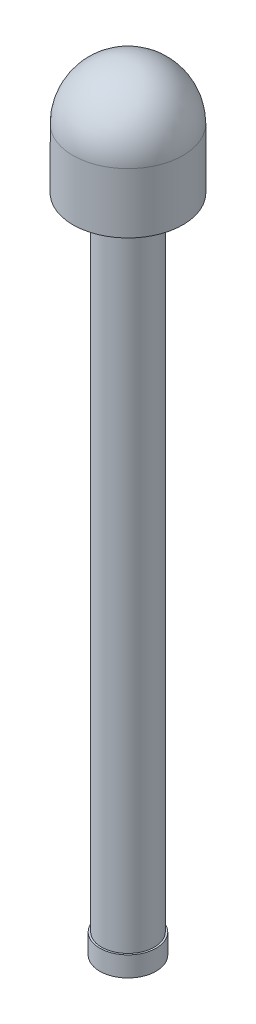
ISO-10303-21;
HEADER;
FILE_DESCRIPTION(('STEP AP214'),'2;1');
FILE_NAME('part.step','',(''),(''),'','','');
FILE_SCHEMA(('AUTOMOTIVE_DESIGN { 1 0 10303 214 1 1 1 1 }'));
ENDSEC;
DATA;
#1=APPLICATION_CONTEXT('core data for automotive mechanical design processes');
#2=APPLICATION_PROTOCOL_DEFINITION('international standard','automotive_design',2000,#1);
#3=PRODUCT_CONTEXT('',#1,'mechanical');
#4=PRODUCT('Part','Part','',(#3));
#5=PRODUCT_RELATED_PRODUCT_CATEGORY('part','',(#4));
#6=PRODUCT_DEFINITION_FORMATION('','',#4);
#7=PRODUCT_DEFINITION_CONTEXT('part definition',#1,'design');
#8=PRODUCT_DEFINITION('design','',#6,#7);
#9=PRODUCT_DEFINITION_SHAPE('','',#8);
#10=(LENGTH_UNIT() NAMED_UNIT(*) SI_UNIT(.MILLI.,.METRE.));
#11=(NAMED_UNIT(*) PLANE_ANGLE_UNIT() SI_UNIT($,.RADIAN.));
#12=(NAMED_UNIT(*) SI_UNIT($,.STERADIAN.) SOLID_ANGLE_UNIT());
#13=UNCERTAINTY_MEASURE_WITH_UNIT(LENGTH_MEASURE(1.E-05),#10,'distance_accuracy_value','');
#14=(GEOMETRIC_REPRESENTATION_CONTEXT(3) GLOBAL_UNCERTAINTY_ASSIGNED_CONTEXT((#13)) GLOBAL_UNIT_ASSIGNED_CONTEXT((#10,
#11,#12)) REPRESENTATION_CONTEXT('',''));
#15=CARTESIAN_POINT('',(0.,0.,0.));
#16=DIRECTION('',(0.,0.,1.));
#17=DIRECTION('',(1.,0.,0.));
#18=AXIS2_PLACEMENT_3D('',#15,#16,#17);
#19=CARTESIAN_POINT('',(0.,0.,0.));
#20=DIRECTION('',(0.,-1.,0.));
#21=DIRECTION('',(0.,0.,-1.));
#22=AXIS2_PLACEMENT_3D('',#19,#20,#21);
#23=PLANE('',#22);
#24=CARTESIAN_POINT('',(0.,0.,0.));
#25=DIRECTION('',(0.,1.,0.));
#26=DIRECTION('',(0.,0.,1.));
#27=AXIS2_PLACEMENT_3D('',#24,#25,#26);
#28=CIRCLE('',#27,14.2875);
#29=CARTESIAN_POINT('',(0.,0.,14.2875));
#30=VERTEX_POINT('',#29);
#31=EDGE_CURVE('E161',#30,#30,#28,.T.);
#32=ORIENTED_EDGE('',*,*,#31,.F.);
#33=EDGE_LOOP('',(#32));
#34=FACE_BOUND('',#33,.T.);
#35=ADVANCED_FACE('F41',(#34),#23,.T.);
#36=CARTESIAN_POINT('',(0.,393.42,0.));
#37=DIRECTION('',(0.,1.,0.));
#38=DIRECTION('',(0.,0.,1.));
#39=AXIS2_PLACEMENT_3D('',#36,#37,#38);
#40=CYLINDRICAL_SURFACE('',#39,14.2875);
#41=ORIENTED_EDGE('',*,*,#31,.T.);
#42=EDGE_LOOP('',(#41));
#43=FACE_BOUND('',#42,.T.);
#44=CARTESIAN_POINT('',(0.,10.16,0.));
#45=DIRECTION('',(0.,1.,0.));
#46=DIRECTION('',(0.,0.,1.));
#47=AXIS2_PLACEMENT_3D('',#44,#45,#46);
#48=CIRCLE('',#47,14.2875);
#49=CARTESIAN_POINT('',(0.,10.16,14.2875));
#50=VERTEX_POINT('',#49);
#51=EDGE_CURVE('E157',#50,#50,#48,.T.);
#52=ORIENTED_EDGE('',*,*,#51,.F.);
#53=EDGE_LOOP('',(#52));
#54=FACE_BOUND('',#53,.T.);
#55=ADVANCED_FACE('F222',(#43,#54),#40,.T.);
#56=CARTESIAN_POINT('',(-14.2875,10.16,0.));
#57=DIRECTION('',(0.,1.,0.));
#58=DIRECTION('',(0.,0.,1.));
#59=AXIS2_PLACEMENT_3D('',#56,#57,#58);
#60=PLANE('',#59);
#61=ORIENTED_EDGE('',*,*,#51,.T.);
#62=EDGE_LOOP('',(#61));
#63=FACE_BOUND('',#62,.T.);
#64=CARTESIAN_POINT('',(0.,10.16,0.));
#65=DIRECTION('',(0.,1.,0.));
#66=DIRECTION('',(0.,0.,1.));
#67=AXIS2_PLACEMENT_3D('',#64,#65,#66);
#68=CIRCLE('',#67,13.39215);
#69=CARTESIAN_POINT('',(0.,10.16,13.39215));
#70=VERTEX_POINT('',#69);
#71=EDGE_CURVE('E153',#70,#70,#68,.T.);
#72=ORIENTED_EDGE('',*,*,#71,.F.);
#73=EDGE_LOOP('',(#72));
#74=FACE_BOUND('',#73,.T.);
#75=ADVANCED_FACE('F226',(#63,#74),#60,.T.);
#76=CARTESIAN_POINT('',(0.,393.42,0.));
#77=DIRECTION('',(0.,1.,0.));
#78=DIRECTION('',(0.,0.,1.));
#79=AXIS2_PLACEMENT_3D('',#76,#77,#78);
#80=CYLINDRICAL_SURFACE('',#79,13.39215);
#81=ORIENTED_EDGE('',*,*,#71,.T.);
#82=EDGE_LOOP('',(#81));
#83=FACE_BOUND('',#82,.T.);
#84=CARTESIAN_POINT('',(0.,335.,0.));
#85=DIRECTION('',(0.,1.,0.));
#86=DIRECTION('',(0.,0.,1.));
#87=AXIS2_PLACEMENT_3D('',#84,#85,#86);
#88=CIRCLE('',#87,13.39215);
#89=CARTESIAN_POINT('',(0.,335.,13.39215));
#90=VERTEX_POINT('',#89);
#91=EDGE_CURVE('E149',#90,#90,#88,.T.);
#92=ORIENTED_EDGE('',*,*,#91,.F.);
#93=EDGE_LOOP('',(#92));
#94=FACE_BOUND('',#93,.T.);
#95=ADVANCED_FACE('F229',(#83,#94),#80,.T.);
#96=CARTESIAN_POINT('',(-13.39215,335.,0.));
#97=DIRECTION('',(0.,-1.,0.));
#98=DIRECTION('',(0.,0.,-1.));
#99=AXIS2_PLACEMENT_3D('',#96,#97,#98);
#100=PLANE('',#99);
#101=ORIENTED_EDGE('',*,*,#91,.T.);
#102=EDGE_LOOP('',(#101));
#103=FACE_BOUND('',#102,.T.);
#104=CARTESIAN_POINT('',(0.,335.,0.));
#105=DIRECTION('',(0.,1.,0.));
#106=DIRECTION('',(0.,0.,1.));
#107=AXIS2_PLACEMENT_3D('',#104,#105,#106);
#108=CIRCLE('',#107,27.94);
#109=CARTESIAN_POINT('',(0.,335.,27.94));
#110=VERTEX_POINT('',#109);
#111=EDGE_CURVE('E139',#110,#110,#108,.T.);
#112=ORIENTED_EDGE('',*,*,#111,.F.);
#113=EDGE_LOOP('',(#112));
#114=FACE_BOUND('',#113,.T.);
#115=ADVANCED_FACE('F203',(#103,#114),#100,.T.);
#116=CARTESIAN_POINT('',(0.,393.42,0.));
#117=DIRECTION('',(0.,1.,0.));
#118=DIRECTION('',(0.,0.,1.));
#119=AXIS2_PLACEMENT_3D('',#116,#117,#118);
#120=CYLINDRICAL_SURFACE('',#119,27.94);
#121=CARTESIAN_POINT('',(0.,358.390458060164,0.));
#122=DIRECTION('',(0.,-1.,0.));
#123=DIRECTION('',(0.,0.,-1.));
#124=AXIS2_PLACEMENT_3D('',#121,#122,#123);
#125=CIRCLE('',#124,27.94);
#126=CARTESIAN_POINT('',(-27.9399741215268,358.390458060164,0.038027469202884));
#127=VERTEX_POINT('',#126);
#128=CARTESIAN_POINT('',(-27.9399741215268,358.390458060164,-0.0380274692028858));
#129=VERTEX_POINT('',#128);
#130=EDGE_CURVE('E142',#127,#129,#125,.T.);
#131=ORIENTED_EDGE('',*,*,#130,.F.);
#132=CARTESIAN_POINT('',(-27.9399741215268,358.390458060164,0.038027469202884));
#133=CARTESIAN_POINT('',(-27.9397395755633,358.390478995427,0.223279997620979));
#134=CARTESIAN_POINT('',(-27.9376279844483,358.383099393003,0.408543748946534));
#135=CARTESIAN_POINT('',(-27.92977696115,358.353466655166,0.77782237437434));
#136=CARTESIAN_POINT('',(-27.9240370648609,358.331211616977,0.961837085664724));
#137=CARTESIAN_POINT('',(-27.9090583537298,358.271765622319,1.32723607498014));
#138=CARTESIAN_POINT('',(-27.8998207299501,358.234579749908,1.50862122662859));
#139=CARTESIAN_POINT('',(-27.8780981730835,358.145367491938,1.86749530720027));
#140=CARTESIAN_POINT('',(-27.8656134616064,358.093342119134,2.04498450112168));
#141=CARTESIAN_POINT('',(-27.8377146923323,357.974590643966,2.39501917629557));
#142=CARTESIAN_POINT('',(-27.8222965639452,357.907844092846,2.56755739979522));
#143=CARTESIAN_POINT('',(-27.7889691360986,357.760061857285,2.90615498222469));
#144=CARTESIAN_POINT('',(-27.7710598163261,357.67902605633,3.07221428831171));
#145=CARTESIAN_POINT('',(-27.7332588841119,357.503215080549,3.39655727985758));
#146=CARTESIAN_POINT('',(-27.713368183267,357.408446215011,3.55484449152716));
#147=CARTESIAN_POINT('',(-27.6721555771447,357.205781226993,3.86257809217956));
#148=CARTESIAN_POINT('',(-27.6508336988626,357.097885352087,4.01202464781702));
#149=CARTESIAN_POINT('',(-27.6076730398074,356.871381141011,4.2989221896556));
#150=CARTESIAN_POINT('',(-27.5858462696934,356.752951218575,4.43651591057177));
#151=CARTESIAN_POINT('',(-27.541970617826,356.504858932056,4.7012193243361));
#152=CARTESIAN_POINT('',(-27.5199216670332,356.375192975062,4.82832563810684));
#153=CARTESIAN_POINT('',(-27.4762044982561,356.105552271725,5.07119489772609));
#154=CARTESIAN_POINT('',(-27.4545363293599,355.965576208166,5.18695638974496));
#155=CARTESIAN_POINT('',(-27.4121697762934,355.676309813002,5.40638874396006));
#156=CARTESIAN_POINT('',(-27.3914714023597,355.527019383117,5.51005947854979));
#157=CARTESIAN_POINT('',(-27.3514798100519,355.21921999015,5.70527346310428));
#158=CARTESIAN_POINT('',(-27.3321960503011,355.060659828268,5.7967379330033));
#159=CARTESIAN_POINT('',(-27.2957067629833,354.736339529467,5.96619682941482));
#160=CARTESIAN_POINT('',(-27.2785005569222,354.57058176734,6.04419565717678));
#161=CARTESIAN_POINT('',(-27.2466294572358,354.233001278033,6.18628254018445));
#162=CARTESIAN_POINT('',(-27.2319640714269,354.061179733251,6.25037329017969));
#163=CARTESIAN_POINT('',(-27.2055702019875,353.712717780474,6.36427146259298));
#164=CARTESIAN_POINT('',(-27.1938411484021,353.536078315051,6.41408165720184));
#165=CARTESIAN_POINT('',(-27.169200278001,353.100637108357,6.51783847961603));
#166=CARTESIAN_POINT('',(-27.1580303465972,352.83981373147,6.56399856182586));
#167=CARTESIAN_POINT('',(-27.1468162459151,352.446067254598,6.61015696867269));
#168=CARTESIAN_POINT('',(-27.1440016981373,352.314453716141,6.62169614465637));
#169=CARTESIAN_POINT('',(-27.1402410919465,352.050726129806,6.63708904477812));
#170=CARTESIAN_POINT('',(-27.1392953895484,351.918611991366,6.64094130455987));
#171=CARTESIAN_POINT('',(-27.1392974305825,351.786458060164,6.64094383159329));
#172=B_SPLINE_CURVE_WITH_KNOTS('',3,(#132,#133,#134,#135,#136,#137,#138,#139,#140,#141,#142,
#143,#144,#145,#146,#147,#148,#149,#150,#151,#152,#153,#154,#155,#156,#157,#158,#159,#160,#161,
#162,#163,#164,#165,#166,#167,#168,#169,#170,#171),.UNSPECIFIED.,.F.,.F.,(4,2,2,2,2,2,2,2,2,2,2,
2,2,2,2,2,2,2,2,4),(0.,0.555621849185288,1.11131478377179,1.66681866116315,2.22228463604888,
2.77852710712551,3.33477411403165,3.89076637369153,4.44674814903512,4.9946522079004,
5.54273211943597,6.0908821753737,6.6390380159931,7.19057625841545,7.74193388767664,
8.29318459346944,8.84432821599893,9.63746521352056,10.0337126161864,10.4300354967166),.UNSPECIFIED.);
#173=CARTESIAN_POINT('',(-27.1392974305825,351.786458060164,6.64094383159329));
#174=VERTEX_POINT('',#173);
#175=EDGE_CURVE('E52',#127,#174,#172,.T.);
#176=ORIENTED_EDGE('',*,*,#175,.T.);
#177=DIRECTION('',(0.,-1.,0.));
#178=VECTOR('',#177,1.);
#179=CARTESIAN_POINT('',(-27.1392974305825,358.390458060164,6.64094383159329));
#180=LINE('',#179,#178);
#181=CARTESIAN_POINT('',(-27.1392974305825,345.16,6.64094383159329));
#182=VERTEX_POINT('',#181);
#183=EDGE_CURVE('E132',#174,#182,#180,.T.);
#184=ORIENTED_EDGE('',*,*,#183,.T.);
#185=CARTESIAN_POINT('',(0.,345.16,0.));
#186=DIRECTION('',(0.,-1.,0.));
#187=DIRECTION('',(0.,0.,-1.));
#188=AXIS2_PLACEMENT_3D('',#185,#186,#187);
#189=CIRCLE('',#188,27.94);
#190=CARTESIAN_POINT('',(-27.1392974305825,345.16,-6.64094383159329));
#191=VERTEX_POINT('',#190);
#192=EDGE_CURVE('E122',#182,#191,#189,.T.);
#193=ORIENTED_EDGE('',*,*,#192,.T.);
#194=DIRECTION('',(0.,-1.,0.));
#195=VECTOR('',#194,1.);
#196=CARTESIAN_POINT('',(-27.1392974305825,358.390458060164,-6.64094383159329));
#197=LINE('',#196,#195);
#198=CARTESIAN_POINT('',(-27.1392974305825,351.786458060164,-6.64094383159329));
#199=VERTEX_POINT('',#198);
#200=EDGE_CURVE('E108',#199,#191,#197,.T.);
#201=ORIENTED_EDGE('',*,*,#200,.F.);
#202=CARTESIAN_POINT('',(-27.1392974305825,351.786458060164,-6.64094383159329));
#203=CARTESIAN_POINT('',(-27.1392791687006,351.97209983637,-6.64095988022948));
#204=CARTESIAN_POINT('',(-27.1411573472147,352.157738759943,-6.63334113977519));
#205=CARTESIAN_POINT('',(-27.1485746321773,352.527690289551,-6.60294994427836));
#206=CARTESIAN_POINT('',(-27.1541135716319,352.712002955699,-6.58017818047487));
#207=CARTESIAN_POINT('',(-27.1687156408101,353.077878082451,-6.51961671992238));
#208=CARTESIAN_POINT('',(-27.1777764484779,353.259442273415,-6.48183691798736));
#209=CARTESIAN_POINT('',(-27.1991664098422,353.618653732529,-6.39148764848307));
#210=CARTESIAN_POINT('',(-27.2114955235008,353.796301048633,-6.33891836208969));
#211=CARTESIAN_POINT('',(-27.2390880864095,354.146479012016,-6.21927993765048));
#212=CARTESIAN_POINT('',(-27.2543525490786,354.31900786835,-6.15220579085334));
#213=CARTESIAN_POINT('',(-27.2873965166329,354.657714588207,-6.00394527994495));
#214=CARTESIAN_POINT('',(-27.305176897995,354.823890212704,-5.92275399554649));
#215=CARTESIAN_POINT('',(-27.3427500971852,355.148583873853,-5.74679934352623));
#216=CARTESIAN_POINT('',(-27.3625422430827,355.307104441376,-5.65204050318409));
#217=CARTESIAN_POINT('',(-27.4035947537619,355.615408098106,-5.44951967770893));
#218=CARTESIAN_POINT('',(-27.4248551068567,355.765191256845,-5.34175779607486));
#219=CARTESIAN_POINT('',(-27.4682058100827,356.054628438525,-5.11416221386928));
#220=CARTESIAN_POINT('',(-27.4902942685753,356.194303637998,-4.99435508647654));
#221=CARTESIAN_POINT('',(-27.534722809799,356.462830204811,-4.74329840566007));
#222=CARTESIAN_POINT('',(-27.5570628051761,356.591685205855,-4.61205272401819));
#223=CARTESIAN_POINT('',(-27.6013823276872,356.837717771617,-4.33894333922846));
#224=CARTESIAN_POINT('',(-27.6233617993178,356.954893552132,-4.19707801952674));
#225=CARTESIAN_POINT('',(-27.6663417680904,357.176710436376,-3.90372931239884));
#226=CARTESIAN_POINT('',(-27.6873422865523,357.281351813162,-3.75224613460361));
#227=CARTESIAN_POINT('',(-27.7275841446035,357.476441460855,-3.44221916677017));
#228=CARTESIAN_POINT('',(-27.7468403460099,357.5670155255,-3.28375645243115));
#229=CARTESIAN_POINT('',(-27.7832884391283,357.734567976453,-2.95957575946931));
#230=CARTESIAN_POINT('',(-27.8004803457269,357.811546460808,-2.79385783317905));
#231=CARTESIAN_POINT('',(-27.8323294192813,357.951438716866,-2.45636860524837));
#232=CARTESIAN_POINT('',(-27.8469868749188,358.01435409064,-2.28459799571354));
#233=CARTESIAN_POINT('',(-27.8733721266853,358.125789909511,-1.93630151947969));
#234=CARTESIAN_POINT('',(-27.8851005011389,358.17431319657,-1.75977659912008));
#235=CARTESIAN_POINT('',(-27.9095320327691,358.273992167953,-1.32872081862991));
#236=CARTESIAN_POINT('',(-27.9206038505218,358.31781481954,-1.07234456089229));
#237=CARTESIAN_POINT('',(-27.9318873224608,358.361482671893,-0.68553959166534));
#238=CARTESIAN_POINT('',(-27.9347609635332,358.372361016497,-0.556315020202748));
#239=CARTESIAN_POINT('',(-27.9387170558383,358.386848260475,-0.297414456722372));
#240=CARTESIAN_POINT('',(-27.9397992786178,358.390456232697,-0.167738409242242));
#241=CARTESIAN_POINT('',(-27.9399741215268,358.390458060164,-0.0380274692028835));
#242=B_SPLINE_CURVE_WITH_KNOTS('',3,(#202,#203,#204,#205,#206,#207,#208,#209,#210,#211,#212,
#213,#214,#215,#216,#217,#218,#219,#220,#221,#222,#223,#224,#225,#226,#227,#228,#229,#230,#231,
#232,#233,#234,#235,#236,#237,#238,#239,#240,#241),.UNSPECIFIED.,.F.,.F.,(4,2,2,2,2,2,2,2,2,2,2,
2,2,2,2,2,2,2,2,4),(0.,0.556755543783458,1.11348569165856,1.66984939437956,2.22620628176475,
2.78275559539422,3.33949927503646,3.89605760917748,4.45261151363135,5.00796347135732,
5.56312817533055,6.11837756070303,6.67361484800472,7.22355903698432,7.77349925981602,
8.32337680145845,8.87314568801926,9.65206757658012,10.0410284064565,10.4300388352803),.UNSPECIFIED.);
#243=EDGE_CURVE('E11',#199,#129,#242,.T.);
#244=ORIENTED_EDGE('',*,*,#243,.T.);
#245=EDGE_LOOP('',(#131,#176,#184,#193,#201,#244));
#246=FACE_BOUND('',#245,.T.);
#247=ORIENTED_EDGE('',*,*,#111,.T.);
#248=EDGE_LOOP('',(#247));
#249=FACE_BOUND('',#248,.T.);
#250=CARTESIAN_POINT('',(0.,365.48,0.));
#251=DIRECTION('',(0.,1.,0.));
#252=DIRECTION('',(0.,0.,1.));
#253=AXIS2_PLACEMENT_3D('',#250,#251,#252);
#254=CIRCLE('',#253,27.94);
#255=CARTESIAN_POINT('',(0.,365.48,27.94));
#256=VERTEX_POINT('',#255);
#257=EDGE_CURVE('E134',#256,#256,#254,.T.);
#258=ORIENTED_EDGE('',*,*,#257,.F.);
#259=EDGE_LOOP('',(#258));
#260=FACE_BOUND('',#259,.T.);
#261=ADVANCED_FACE('F129',(#246,#249,#260),#120,.T.);
#262=CARTESIAN_POINT('',(0.,365.48,0.));
#263=DIRECTION('',(0.,1.,0.));
#264=DIRECTION('',(-1.,0.,0.));
#265=AXIS2_PLACEMENT_3D('',#262,#263,#264);
#266=SPHERICAL_SURFACE('',#265,27.94);
#267=ORIENTED_EDGE('',*,*,#257,.T.);
#268=EDGE_LOOP('',(#267));
#269=FACE_BOUND('',#268,.T.);
#270=ADVANCED_FACE('F196',(#269),#266,.T.);
#271=CARTESIAN_POINT('',(-27.1392974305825,345.16,6.64094383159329));
#272=DIRECTION('',(0.,1.,0.));
#273=DIRECTION('',(0.,0.,1.));
#274=AXIS2_PLACEMENT_3D('',#271,#272,#273);
#275=PLANE('',#274);
#276=CARTESIAN_POINT('',(0.,345.16,0.));
#277=DIRECTION('',(0.,-1.,0.));
#278=DIRECTION('',(0.,0.,-1.));
#279=AXIS2_PLACEMENT_3D('',#276,#277,#278);
#280=CIRCLE('',#279,26.67);
#281=CARTESIAN_POINT('',(-25.9056930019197,345.16,6.33908274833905));
#282=VERTEX_POINT('',#281);
#283=CARTESIAN_POINT('',(-25.9056930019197,345.16,-6.33908274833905));
#284=VERTEX_POINT('',#283);
#285=EDGE_CURVE('E124',#282,#284,#280,.T.);
#286=ORIENTED_EDGE('',*,*,#285,.T.);
#287=DIRECTION('',(0.971342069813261,0.,0.237685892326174));
#288=VECTOR('',#287,1.);
#289=CARTESIAN_POINT('',(-27.1392974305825,345.16,-6.64094383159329));
#290=LINE('',#289,#288);
#291=EDGE_CURVE('E111',#191,#284,#290,.T.);
#292=ORIENTED_EDGE('',*,*,#291,.F.);
#293=ORIENTED_EDGE('',*,*,#192,.F.);
#294=DIRECTION('',(0.971342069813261,0.,-0.237685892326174));
#295=VECTOR('',#294,1.);
#296=CARTESIAN_POINT('',(-27.1392974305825,345.16,6.64094383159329));
#297=LINE('',#296,#295);
#298=EDGE_CURVE('E347',#182,#282,#297,.T.);
#299=ORIENTED_EDGE('',*,*,#298,.T.);
#300=EDGE_LOOP('',(#286,#292,#293,#299));
#301=FACE_BOUND('',#300,.T.);
#302=ADVANCED_FACE('F120',(#301),#275,.T.);
#303=CARTESIAN_POINT('',(0.,335.220960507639,0.));
#304=DIRECTION('',(0.,-1.,0.));
#305=DIRECTION('',(0.,0.,-1.));
#306=AXIS2_PLACEMENT_3D('',#303,#304,#305);
#307=CYLINDRICAL_SURFACE('',#306,26.67);
#308=DIRECTION('',(0.,1.,0.));
#309=VECTOR('',#308,1.);
#310=CARTESIAN_POINT('',(-25.9056930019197,358.390458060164,6.33908274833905));
#311=LINE('',#310,#309);
#312=CARTESIAN_POINT('',(-25.9056930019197,351.786458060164,6.33908274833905));
#313=VERTEX_POINT('',#312);
#314=EDGE_CURVE('E349',#282,#313,#311,.T.);
#315=ORIENTED_EDGE('',*,*,#314,.T.);
#316=CARTESIAN_POINT('',(-25.9056930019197,351.786458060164,6.33908274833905));
#317=CARTESIAN_POINT('',(-25.9056741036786,351.972081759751,6.33909863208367));
#318=CARTESIAN_POINT('',(-25.9075525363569,352.157702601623,6.33148153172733));
#319=CARTESIAN_POINT('',(-25.9149675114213,352.527618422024,6.30109603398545));
#320=CARTESIAN_POINT('',(-25.9205038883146,352.711913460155,6.2783283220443));
#321=CARTESIAN_POINT('',(-25.935094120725,353.077771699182,6.21777327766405));
#322=CARTESIAN_POINT('',(-25.9441459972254,353.259336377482,6.17999439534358));
#323=CARTESIAN_POINT('',(-25.9655023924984,353.618549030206,6.08964309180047));
#324=CARTESIAN_POINT('',(-25.9778068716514,353.79619705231,6.03707085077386));
#325=CARTESIAN_POINT('',(-26.0053223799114,354.146373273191,5.91742090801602));
#326=CARTESIAN_POINT('',(-26.0205343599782,354.318899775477,5.85033845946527));
#327=CARTESIAN_POINT('',(-26.0534314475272,354.65760524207,5.70205025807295));
#328=CARTESIAN_POINT('',(-26.0711174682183,354.823781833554,5.62083928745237));
#329=CARTESIAN_POINT('',(-26.1084380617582,355.14843381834,5.44485475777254));
#330=CARTESIAN_POINT('',(-26.128071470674,355.306913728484,5.35008928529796));
#331=CARTESIAN_POINT('',(-26.168735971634,355.615196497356,5.14750717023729));
#332=CARTESIAN_POINT('',(-26.1897675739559,355.764996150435,5.03968575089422));
#333=CARTESIAN_POINT('',(-26.2325514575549,356.054373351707,4.81201803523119));
#334=CARTESIAN_POINT('',(-26.2543015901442,356.1939779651,4.6922057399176));
#335=CARTESIAN_POINT('',(-26.2979444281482,356.462415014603,4.44108711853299));
#336=CARTESIAN_POINT('',(-26.3198371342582,356.591247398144,4.30978073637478));
#337=CARTESIAN_POINT('',(-26.363123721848,356.837218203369,4.03654992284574));
#338=CARTESIAN_POINT('',(-26.3845175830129,356.954356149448,3.8946250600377));
#339=CARTESIAN_POINT('',(-26.4261733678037,357.176101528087,3.60114183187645));
#340=CARTESIAN_POINT('',(-26.4464352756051,357.280708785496,3.44958333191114));
#341=CARTESIAN_POINT('',(-26.4850148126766,357.475613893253,3.1395891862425));
#342=CARTESIAN_POINT('',(-26.5033509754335,357.566053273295,2.98124480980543));
#343=CARTESIAN_POINT('',(-26.5377920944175,357.733404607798,2.65726047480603));
#344=CARTESIAN_POINT('',(-26.5538962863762,357.810311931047,2.4916180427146));
#345=CARTESIAN_POINT('',(-26.5833825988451,357.950073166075,2.15436869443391));
#346=CARTESIAN_POINT('',(-26.596766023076,358.012933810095,1.98276468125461));
#347=CARTESIAN_POINT('',(-26.6204263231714,358.124353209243,1.6346983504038));
#348=CARTESIAN_POINT('',(-26.6307020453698,358.172906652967,1.45823425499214));
#349=CARTESIAN_POINT('',(-26.6478097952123,358.255408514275,1.10219075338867));
#350=CARTESIAN_POINT('',(-26.6546496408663,358.289390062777,0.922619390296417));
#351=CARTESIAN_POINT('',(-26.664708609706,358.342877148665,0.561171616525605));
#352=CARTESIAN_POINT('',(-26.6679264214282,358.36237744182,0.379294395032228));
#353=CARTESIAN_POINT('',(-26.6706191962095,358.386960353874,0.0145982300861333));
#354=CARTESIAN_POINT('',(-26.6700952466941,358.392047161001,-0.168220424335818));
#355=CARTESIAN_POINT('',(-26.6652860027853,358.388007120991,-0.533710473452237));
#356=CARTESIAN_POINT('',(-26.6609992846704,358.378874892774,-0.716381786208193));
#357=CARTESIAN_POINT('',(-26.6485330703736,358.346144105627,-1.08622541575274));
#358=CARTESIAN_POINT('',(-26.6402328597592,358.322089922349,-1.27335364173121));
#359=CARTESIAN_POINT('',(-26.6198729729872,358.259515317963,-1.64498950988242));
#360=CARTESIAN_POINT('',(-26.6078119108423,358.220989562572,-1.82949615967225));
#361=CARTESIAN_POINT('',(-26.5663419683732,358.084310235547,-2.37740026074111));
#362=CARTESIAN_POINT('',(-26.5316400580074,357.965038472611,-2.73535807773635));
#363=CARTESIAN_POINT('',(-26.4486113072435,357.665160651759,-3.44922480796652));
#364=CARTESIAN_POINT('',(-26.3995742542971,357.481216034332,-3.80363636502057));
#365=CARTESIAN_POINT('',(-26.2937380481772,357.059083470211,-4.47709057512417));
#366=CARTESIAN_POINT('',(-26.2369433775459,356.820926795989,-4.79615346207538));
#367=CARTESIAN_POINT('',(-26.1325323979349,356.345865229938,-5.33286185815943));
#368=CARTESIAN_POINT('',(-26.0852539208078,356.117545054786,-5.55820682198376));
#369=CARTESIAN_POINT('',(-25.9929249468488,355.631550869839,-5.97517455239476));
#370=CARTESIAN_POINT('',(-25.9478747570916,355.373872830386,-6.16679268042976));
#371=CARTESIAN_POINT('',(-25.9056930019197,355.102958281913,-6.33908274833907));
#372=B_SPLINE_CURVE_WITH_KNOTS('',3,(#316,#317,#318,#319,#320,#321,#322,#323,#324,#325,#326,
#327,#328,#329,#330,#331,#332,#333,#334,#335,#336,#337,#338,#339,#340,#341,#342,#343,#344,#345,
#346,#347,#348,#349,#350,#351,#352,#353,#354,#355,#356,#357,#358,#359,#360,#361,#362,#363,#364,
#365,#366,#367,#368,#369,#370,#371),.UNSPECIFIED.,.F.,.F.,(4,2,2,2,2,2,2,2,2,2,2,2,2,2,2,2,2,2,
2,2,2,2,2,2,2,2,2,4),(0.,0.556701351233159,1.11337751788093,1.6697407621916,2.22609722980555,
2.7826359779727,3.33938069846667,3.89579464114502,4.4524127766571,5.00749504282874,
5.56258001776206,6.11768755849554,6.67280285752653,7.22196022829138,7.77130517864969,
8.32038627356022,8.8696709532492,9.41770006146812,9.9659275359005,10.5139956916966,
11.062271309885,11.6281728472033,12.1942831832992,13.3259786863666,14.5277011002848,
15.7287320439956,16.6985580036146,17.6685172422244),.UNSPECIFIED.);
#373=CARTESIAN_POINT('',(-26.67,358.385142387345,0.));
#374=VERTEX_POINT('',#373);
#375=EDGE_CURVE('E71',#313,#374,#372,.T.);
#376=ORIENTED_EDGE('',*,*,#375,.T.);
#377=CARTESIAN_POINT('',(-25.9056930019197,355.102958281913,6.33908274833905));
#378=CARTESIAN_POINT('',(-25.9319200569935,355.271491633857,6.23191242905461));
#379=CARTESIAN_POINT('',(-25.9592849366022,355.434980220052,6.11719334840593));
#380=CARTESIAN_POINT('',(-26.0153954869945,355.750989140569,5.87397819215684));
#381=CARTESIAN_POINT('',(-26.0441404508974,355.903514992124,5.7454891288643));
#382=CARTESIAN_POINT('',(-26.1020969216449,356.196650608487,5.47616529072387));
#383=CARTESIAN_POINT('',(-26.1313075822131,356.337279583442,5.33535119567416));
#384=CARTESIAN_POINT('',(-26.1894280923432,356.606287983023,5.04232766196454));
#385=CARTESIAN_POINT('',(-26.2183378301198,356.734662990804,4.89011414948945));
#386=CARTESIAN_POINT('',(-26.2750219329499,356.978266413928,4.5757603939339));
#387=CARTESIAN_POINT('',(-26.3027982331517,357.093517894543,4.41363836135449));
#388=CARTESIAN_POINT('',(-26.3565607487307,357.310545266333,4.0803307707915));
#389=CARTESIAN_POINT('',(-26.3825469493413,357.412321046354,3.90914513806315));
#390=CARTESIAN_POINT('',(-26.4320990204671,357.601867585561,3.55870402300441));
#391=CARTESIAN_POINT('',(-26.4556632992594,357.68962915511,3.37944334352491));
#392=CARTESIAN_POINT('',(-26.4997660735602,357.850445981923,3.01415501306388));
#393=CARTESIAN_POINT('',(-26.5203055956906,357.923506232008,2.82812968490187));
#394=CARTESIAN_POINT('',(-26.5584980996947,358.056569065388,2.44408411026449));
#395=CARTESIAN_POINT('',(-26.5760309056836,358.116050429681,2.24587084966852));
#396=CARTESIAN_POINT('',(-26.6068736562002,358.218059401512,1.8448824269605));
#397=CARTESIAN_POINT('',(-26.6201852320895,358.260593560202,1.64210905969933));
#398=CARTESIAN_POINT('',(-26.6422489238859,358.328154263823,1.23342702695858));
#399=CARTESIAN_POINT('',(-26.6510013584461,358.353182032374,1.02751858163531));
#400=CARTESIAN_POINT('',(-26.6637292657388,358.385228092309,0.61415692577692));
#401=CARTESIAN_POINT('',(-26.6677050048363,358.392247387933,0.406703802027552));
#402=CARTESIAN_POINT('',(-26.6707363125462,358.387991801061,0.00117122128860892));
#403=CARTESIAN_POINT('',(-26.6700026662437,358.377515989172,-0.196915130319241));
#404=CARTESIAN_POINT('',(-26.664171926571,358.339571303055,-0.591387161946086));
#405=CARTESIAN_POINT('',(-26.6590750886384,358.312103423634,-0.787772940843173));
#406=CARTESIAN_POINT('',(-26.6447194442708,358.240142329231,-1.17719230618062));
#407=CARTESIAN_POINT('',(-26.6354618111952,358.195653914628,-1.37022682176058));
#408=CARTESIAN_POINT('',(-26.6131172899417,358.089786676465,-1.75137912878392));
#409=CARTESIAN_POINT('',(-26.6000305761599,358.028408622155,-1.93949714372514));
#410=CARTESIAN_POINT('',(-26.5713636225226,357.893222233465,-2.29825674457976));
#411=CARTESIAN_POINT('',(-26.5559771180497,357.820366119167,-2.46927334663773));
#412=CARTESIAN_POINT('',(-26.5226951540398,357.660422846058,-2.80425960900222));
#413=CARTESIAN_POINT('',(-26.5047997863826,357.573336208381,-2.96822952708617));
#414=CARTESIAN_POINT('',(-26.4670469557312,357.385505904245,-3.28789170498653));
#415=CARTESIAN_POINT('',(-26.4471896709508,357.284763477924,-3.44358471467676));
#416=CARTESIAN_POINT('',(-26.4061125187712,357.070311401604,-3.74557710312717));
#417=CARTESIAN_POINT('',(-26.3848926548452,356.956601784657,-3.89187650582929));
#418=CARTESIAN_POINT('',(-26.3421856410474,356.719569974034,-4.17105244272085));
#419=CARTESIAN_POINT('',(-26.3207136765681,356.596502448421,-4.30414767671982));
#420=CARTESIAN_POINT('',(-26.2776815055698,356.339539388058,-4.55950982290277));
#421=CARTESIAN_POINT('',(-26.2561212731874,356.205640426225,-4.68177328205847));
#422=CARTESIAN_POINT('',(-26.2135323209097,355.92799504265,-4.91463498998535));
#423=CARTESIAN_POINT('',(-26.1925035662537,355.784249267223,-5.02523400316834));
#424=CARTESIAN_POINT('',(-26.1515679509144,355.487905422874,-5.23409233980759));
#425=CARTESIAN_POINT('',(-26.1316611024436,355.335307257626,-5.33235152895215));
#426=CARTESIAN_POINT('',(-26.093366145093,355.021003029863,-5.5167097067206));
#427=CARTESIAN_POINT('',(-26.0749922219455,354.859231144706,-5.60269943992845));
#428=CARTESIAN_POINT('',(-26.0404783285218,354.528962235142,-5.760985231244));
#429=CARTESIAN_POINT('',(-26.0243376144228,354.360467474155,-5.83328585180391));
#430=CARTESIAN_POINT('',(-25.9947425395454,354.017925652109,-5.96378581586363));
#431=CARTESIAN_POINT('',(-25.9812874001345,353.843880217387,-6.02198924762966));
#432=CARTESIAN_POINT('',(-25.9574390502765,353.491479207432,-6.12396871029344));
#433=CARTESIAN_POINT('',(-25.9470450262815,353.313124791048,-6.16774857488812));
#434=CARTESIAN_POINT('',(-25.9275964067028,352.911705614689,-6.24906534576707));
#435=CARTESIAN_POINT('',(-25.9194035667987,352.687815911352,-6.28283385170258));
#436=CARTESIAN_POINT('',(-25.9111896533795,352.350477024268,-6.31658624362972));
#437=CARTESIAN_POINT('',(-25.909130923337,352.237852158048,-6.32502030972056));
#438=CARTESIAN_POINT('',(-25.90638202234,352.01231192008,-6.33626786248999));
#439=CARTESIAN_POINT('',(-25.9056917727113,351.899396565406,-6.33908167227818));
#440=CARTESIAN_POINT('',(-25.9056930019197,351.786458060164,-6.33908274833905));
#441=B_SPLINE_CURVE_WITH_KNOTS('',3,(#377,#378,#379,#380,#381,#382,#383,#384,#385,#386,#387,
#388,#389,#390,#391,#392,#393,#394,#395,#396,#397,#398,#399,#400,#401,#402,#403,#404,#405,#406,
#407,#408,#409,#410,#411,#412,#413,#414,#415,#416,#417,#418,#419,#420,#421,#422,#423,#424,#425,
#426,#427,#428,#429,#430,#431,#432,#433,#434,#435,#436,#437,#438,#439,#440),.UNSPECIFIED.,.F.,
.F.,(4,2,2,2,2,2,2,2,2,2,2,2,2,2,2,2,2,2,2,2,2,2,2,2,2,2,2,2,2,2,2,4),(0.,0.604023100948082,
1.20774005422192,1.81046278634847,2.41340195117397,3.01526450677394,3.61713202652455,
4.21939260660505,4.8214483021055,5.4437330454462,6.06577700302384,6.68777747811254,
7.30974326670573,7.90407101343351,8.49836396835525,9.09248943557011,9.68658784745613,
10.245478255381,10.80434820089,11.3631674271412,11.9219852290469,12.4689647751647,
13.0161180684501,13.5632354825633,14.1103588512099,14.6620850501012,15.2136270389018,
15.7650088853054,16.3162440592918,16.9946090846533,17.333360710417,17.6720928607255),.UNSPECIFIED.);
#442=CARTESIAN_POINT('',(-25.9056930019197,351.786458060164,-6.33908274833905));
#443=VERTEX_POINT('',#442);
#444=EDGE_CURVE('E175',#374,#443,#441,.T.);
#445=ORIENTED_EDGE('',*,*,#444,.T.);
#446=DIRECTION('',(0.,1.,0.));
#447=VECTOR('',#446,1.);
#448=CARTESIAN_POINT('',(-25.9056930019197,358.390458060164,-6.33908274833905));
#449=LINE('',#448,#447);
#450=EDGE_CURVE('E126',#284,#443,#449,.T.);
#451=ORIENTED_EDGE('',*,*,#450,.F.);
#452=ORIENTED_EDGE('',*,*,#285,.F.);
#453=EDGE_LOOP('',(#315,#376,#445,#451,#452));
#454=FACE_BOUND('',#453,.T.);
#455=ADVANCED_FACE('F186',(#454),#307,.T.);
#456=CARTESIAN_POINT('',(-27.1392974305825,358.390458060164,6.64094383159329));
#457=DIRECTION('',(0.,-1.,0.));
#458=DIRECTION('',(0.,0.,-1.));
#459=AXIS2_PLACEMENT_3D('',#456,#457,#458);
#460=PLANE('',#459);
#461=DIRECTION('',(-0.971342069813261,0.,-0.237685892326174));
#462=VECTOR('',#461,1.);
#463=CARTESIAN_POINT('',(-27.4753706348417,358.390458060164,0.0756602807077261));
#464=LINE('',#463,#462);
#465=CARTESIAN_POINT('',(-27.7845686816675,358.390458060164,0.));
#466=VERTEX_POINT('',#465);
#467=EDGE_CURVE('E165',#129,#466,#464,.F.);
#468=ORIENTED_EDGE('',*,*,#467,.T.);
#469=DIRECTION('',(-0.971342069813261,0.,0.237685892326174));
#470=VECTOR('',#469,1.);
#471=CARTESIAN_POINT('',(-28.7089750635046,358.390458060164,0.226200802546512));
#472=LINE('',#471,#470);
#473=EDGE_CURVE('E168',#466,#127,#472,.T.);
#474=ORIENTED_EDGE('',*,*,#473,.T.);
#475=ORIENTED_EDGE('',*,*,#130,.T.);
#476=EDGE_LOOP('',(#468,#474,#475));
#477=FACE_BOUND('',#476,.T.);
#478=ADVANCED_FACE('F191',(#477),#460,.T.);
#479=CARTESIAN_POINT('',(0.,0.,0.));
#480=DIRECTION('',(0.237685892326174,0.,0.971342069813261));
#481=DIRECTION('',(0.971342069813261,0.,-0.237685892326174));
#482=AXIS2_PLACEMENT_3D('',#479,#480,#481);
#483=PLANE('',#482);
#484=ORIENTED_EDGE('',*,*,#183,.F.);
#485=DIRECTION('',(-0.971342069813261,0.,0.237685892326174));
#486=VECTOR('',#485,1.);
#487=CARTESIAN_POINT('',(0.,351.786458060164,0.));
#488=LINE('',#487,#486);
#489=EDGE_CURVE('E172',#174,#313,#488,.F.);
#490=ORIENTED_EDGE('',*,*,#489,.T.);
#491=ORIENTED_EDGE('',*,*,#314,.F.);
#492=ORIENTED_EDGE('',*,*,#298,.F.);
#493=EDGE_LOOP('',(#484,#490,#491,#492));
#494=FACE_BOUND('',#493,.T.);
#495=ADVANCED_FACE('F266',(#494),#483,.F.);
#496=CARTESIAN_POINT('',(0.,0.,0.));
#497=DIRECTION('',(-0.237685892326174,0.,0.971342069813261));
#498=DIRECTION('',(0.971342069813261,0.,0.237685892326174));
#499=AXIS2_PLACEMENT_3D('',#496,#497,#498);
#500=PLANE('',#499);
#501=ORIENTED_EDGE('',*,*,#450,.T.);
#502=DIRECTION('',(-0.971342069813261,0.,-0.237685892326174));
#503=VECTOR('',#502,1.);
#504=CARTESIAN_POINT('',(-27.1392974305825,351.786458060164,-6.64094383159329));
#505=LINE('',#504,#503);
#506=EDGE_CURVE('E62',#443,#199,#505,.T.);
#507=ORIENTED_EDGE('',*,*,#506,.T.);
#508=ORIENTED_EDGE('',*,*,#200,.T.);
#509=ORIENTED_EDGE('',*,*,#291,.T.);
#510=EDGE_LOOP('',(#501,#507,#508,#509));
#511=FACE_BOUND('',#510,.T.);
#512=ADVANCED_FACE('F110',(#511),#500,.T.);
#513=CARTESIAN_POINT('',(-1.56967763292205,351.786458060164,6.41474302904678));
#514=DIRECTION('',(0.971342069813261,0.,0.237685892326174));
#515=DIRECTION('',(0.237685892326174,0.,-0.971342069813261));
#516=AXIS2_PLACEMENT_3D('',#513,#514,#515);
#517=CYLINDRICAL_SURFACE('',#516,6.604);
#518=ORIENTED_EDGE('',*,*,#506,.F.);
#519=ORIENTED_EDGE('',*,*,#444,.F.);
#520=CARTESIAN_POINT('',(-27.7845686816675,351.786458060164,0.));
#521=DIRECTION('',(0.,0.,1.));
#522=DIRECTION('',(1.,0.,0.));
#523=AXIS2_PLACEMENT_3D('',#520,#521,#522);
#524=ELLIPSE('',#523,27.7845686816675,6.604);
#525=EDGE_CURVE('E46',#466,#374,#524,.F.);
#526=ORIENTED_EDGE('',*,*,#525,.F.);
#527=ORIENTED_EDGE('',*,*,#467,.F.);
#528=ORIENTED_EDGE('',*,*,#243,.F.);
#529=EDGE_LOOP('',(#518,#519,#526,#527,#528));
#530=FACE_BOUND('',#529,.T.);
#531=ADVANCED_FACE('F43',(#530),#517,.F.);
#532=CARTESIAN_POINT('',(-28.7089750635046,351.786458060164,0.226200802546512));
#533=DIRECTION('',(-0.971342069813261,0.,0.237685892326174));
#534=DIRECTION('',(0.237685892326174,0.,0.971342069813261));
#535=AXIS2_PLACEMENT_3D('',#532,#533,#534);
#536=CYLINDRICAL_SURFACE('',#535,6.604);
#537=ORIENTED_EDGE('',*,*,#375,.F.);
#538=ORIENTED_EDGE('',*,*,#489,.F.);
#539=ORIENTED_EDGE('',*,*,#175,.F.);
#540=ORIENTED_EDGE('',*,*,#473,.F.);
#541=ORIENTED_EDGE('',*,*,#525,.T.);
#542=EDGE_LOOP('',(#537,#538,#539,#540,#541));
#543=FACE_BOUND('',#542,.T.);
#544=ADVANCED_FACE('F214',(#543),#536,.F.);
#545=CLOSED_SHELL('',(#35,#55,#75,#95,#115,#261,#270,#302,#455,#478,#495,#512,#531,#544));
#546=MANIFOLD_SOLID_BREP('B2',#545);
#547=ADVANCED_BREP_SHAPE_REPRESENTATION('',(#18,#546),#14);
#548=SHAPE_DEFINITION_REPRESENTATION(#9,#547);
ENDSEC;
END-ISO-10303-21;
